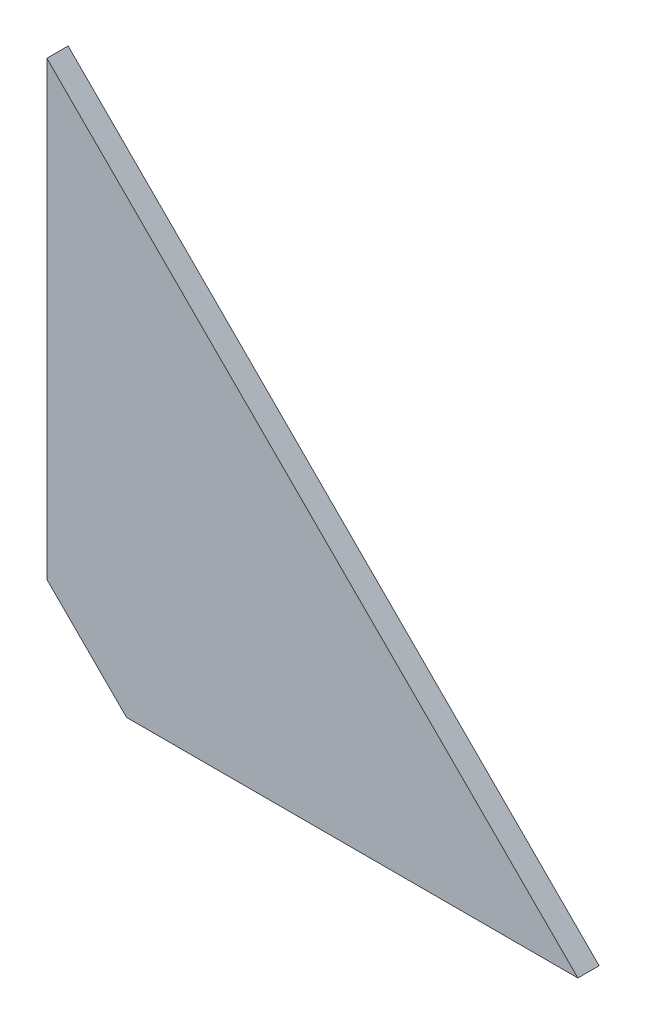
from build123d import *

# Parameters (mm, degrees)
BASE_EXTRUSION_DEPTH = 8


with BuildPart() as part:
    # Esquisse1 → Base-Extrusion (new body)
    with BuildSketch(Plane.XY):
        Polygon((0, 200), (200, 0), (30, 0), (0, 30), align=None)
    extrude(amount=BASE_EXTRUSION_DEPTH)


solid = part.part
